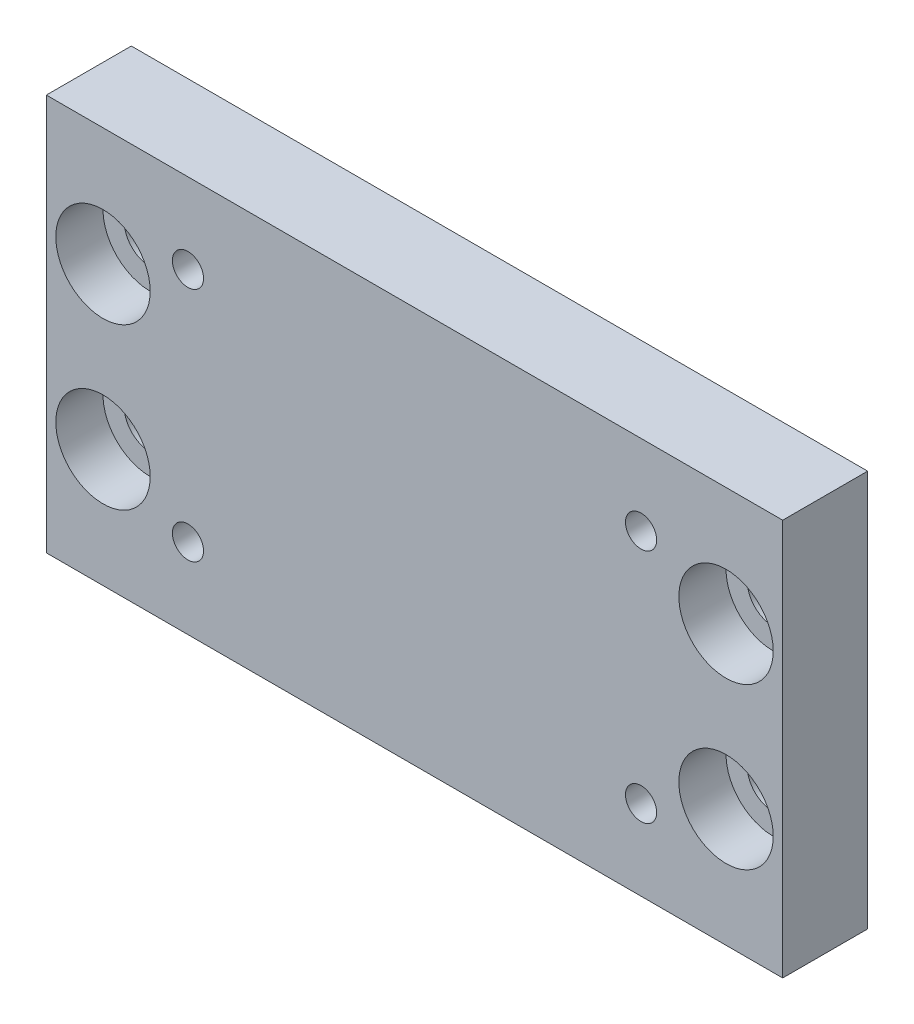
ISO-10303-21;
HEADER;
FILE_DESCRIPTION(('STEP AP214'),'2;1');
FILE_NAME('part.step','',(''),(''),'','','');
FILE_SCHEMA(('AUTOMOTIVE_DESIGN { 1 0 10303 214 1 1 1 1 }'));
ENDSEC;
DATA;
#1=APPLICATION_CONTEXT('core data for automotive mechanical design processes');
#2=APPLICATION_PROTOCOL_DEFINITION('international standard','automotive_design',2000,#1);
#3=PRODUCT_CONTEXT('',#1,'mechanical');
#4=PRODUCT('Part','Part','',(#3));
#5=PRODUCT_RELATED_PRODUCT_CATEGORY('part','',(#4));
#6=PRODUCT_DEFINITION_FORMATION('','',#4);
#7=PRODUCT_DEFINITION_CONTEXT('part definition',#1,'design');
#8=PRODUCT_DEFINITION('design','',#6,#7);
#9=PRODUCT_DEFINITION_SHAPE('','',#8);
#10=(LENGTH_UNIT() NAMED_UNIT(*) SI_UNIT(.MILLI.,.METRE.));
#11=(NAMED_UNIT(*) PLANE_ANGLE_UNIT() SI_UNIT($,.RADIAN.));
#12=(NAMED_UNIT(*) SI_UNIT($,.STERADIAN.) SOLID_ANGLE_UNIT());
#13=UNCERTAINTY_MEASURE_WITH_UNIT(LENGTH_MEASURE(1.E-05),#10,'distance_accuracy_value','');
#14=(GEOMETRIC_REPRESENTATION_CONTEXT(3) GLOBAL_UNCERTAINTY_ASSIGNED_CONTEXT((#13)) GLOBAL_UNIT_ASSIGNED_CONTEXT((#10,
#11,#12)) REPRESENTATION_CONTEXT('',''));
#15=CARTESIAN_POINT('',(0.,0.,0.));
#16=DIRECTION('',(0.,0.,1.));
#17=DIRECTION('',(1.,0.,0.));
#18=AXIS2_PLACEMENT_3D('',#15,#16,#17);
#19=CARTESIAN_POINT('',(-39.,21.,9.));
#20=DIRECTION('',(1.,0.,0.));
#21=DIRECTION('',(0.,0.,-1.));
#22=AXIS2_PLACEMENT_3D('',#19,#20,#21);
#23=PLANE('',#22);
#24=DIRECTION('',(0.,-1.,0.));
#25=VECTOR('',#24,1.);
#26=CARTESIAN_POINT('',(-39.,21.,0.));
#27=LINE('',#26,#25);
#28=CARTESIAN_POINT('',(-39.,21.,0.));
#29=VERTEX_POINT('',#28);
#30=CARTESIAN_POINT('',(-39.,-21.,0.));
#31=VERTEX_POINT('',#30);
#32=EDGE_CURVE('E82',#29,#31,#27,.T.);
#33=ORIENTED_EDGE('',*,*,#32,.T.);
#34=DIRECTION('',(0.,0.,-1.));
#35=VECTOR('',#34,1.);
#36=CARTESIAN_POINT('',(-39.,-21.,9.));
#37=LINE('',#36,#35);
#38=CARTESIAN_POINT('',(-39.,-21.,9.));
#39=VERTEX_POINT('',#38);
#40=EDGE_CURVE('E11',#39,#31,#37,.T.);
#41=ORIENTED_EDGE('',*,*,#40,.F.);
#42=DIRECTION('',(0.,-1.,0.));
#43=VECTOR('',#42,1.);
#44=CARTESIAN_POINT('',(-39.,21.,9.));
#45=LINE('',#44,#43);
#46=CARTESIAN_POINT('',(-39.,21.,9.));
#47=VERTEX_POINT('',#46);
#48=EDGE_CURVE('E105',#47,#39,#45,.T.);
#49=ORIENTED_EDGE('',*,*,#48,.F.);
#50=DIRECTION('',(0.,0.,-1.));
#51=VECTOR('',#50,1.);
#52=CARTESIAN_POINT('',(-39.,21.,9.));
#53=LINE('',#52,#51);
#54=EDGE_CURVE('E94',#47,#29,#53,.T.);
#55=ORIENTED_EDGE('',*,*,#54,.T.);
#56=EDGE_LOOP('',(#33,#41,#49,#55));
#57=FACE_BOUND('',#56,.T.);
#58=ADVANCED_FACE('F36',(#57),#23,.F.);
#59=CARTESIAN_POINT('',(-39.,-21.,9.));
#60=DIRECTION('',(0.,1.,0.));
#61=DIRECTION('',(-1.,0.,0.));
#62=AXIS2_PLACEMENT_3D('',#59,#60,#61);
#63=PLANE('',#62);
#64=DIRECTION('',(1.,0.,0.));
#65=VECTOR('',#64,1.);
#66=CARTESIAN_POINT('',(-39.,-21.,0.));
#67=LINE('',#66,#65);
#68=CARTESIAN_POINT('',(39.,-21.,0.));
#69=VERTEX_POINT('',#68);
#70=EDGE_CURVE('E78',#31,#69,#67,.T.);
#71=ORIENTED_EDGE('',*,*,#70,.T.);
#72=DIRECTION('',(0.,0.,-1.));
#73=VECTOR('',#72,1.);
#74=CARTESIAN_POINT('',(39.,-21.,9.));
#75=LINE('',#74,#73);
#76=CARTESIAN_POINT('',(39.,-21.,9.));
#77=VERTEX_POINT('',#76);
#78=EDGE_CURVE('E44',#77,#69,#75,.T.);
#79=ORIENTED_EDGE('',*,*,#78,.F.);
#80=DIRECTION('',(1.,0.,0.));
#81=VECTOR('',#80,1.);
#82=CARTESIAN_POINT('',(-39.,-21.,9.));
#83=LINE('',#82,#81);
#84=EDGE_CURVE('E90',#39,#77,#83,.T.);
#85=ORIENTED_EDGE('',*,*,#84,.F.);
#86=ORIENTED_EDGE('',*,*,#40,.T.);
#87=EDGE_LOOP('',(#71,#79,#85,#86));
#88=FACE_BOUND('',#87,.T.);
#89=ADVANCED_FACE('F89',(#88),#63,.F.);
#90=CARTESIAN_POINT('',(39.,21.,9.));
#91=DIRECTION('',(-1.,0.,0.));
#92=DIRECTION('',(0.,-1.,0.));
#93=AXIS2_PLACEMENT_3D('',#90,#91,#92);
#94=PLANE('',#93);
#95=DIRECTION('',(0.,1.,0.));
#96=VECTOR('',#95,1.);
#97=CARTESIAN_POINT('',(39.,21.,0.));
#98=LINE('',#97,#96);
#99=CARTESIAN_POINT('',(39.,21.,0.));
#100=VERTEX_POINT('',#99);
#101=EDGE_CURVE('E83',#69,#100,#98,.T.);
#102=ORIENTED_EDGE('',*,*,#101,.T.);
#103=DIRECTION('',(0.,0.,-1.));
#104=VECTOR('',#103,1.);
#105=CARTESIAN_POINT('',(39.,21.,9.));
#106=LINE('',#105,#104);
#107=CARTESIAN_POINT('',(39.,21.,9.));
#108=VERTEX_POINT('',#107);
#109=EDGE_CURVE('E111',#108,#100,#106,.T.);
#110=ORIENTED_EDGE('',*,*,#109,.F.);
#111=DIRECTION('',(0.,1.,0.));
#112=VECTOR('',#111,1.);
#113=CARTESIAN_POINT('',(39.,21.,9.));
#114=LINE('',#113,#112);
#115=EDGE_CURVE('E57',#77,#108,#114,.T.);
#116=ORIENTED_EDGE('',*,*,#115,.F.);
#117=ORIENTED_EDGE('',*,*,#78,.T.);
#118=EDGE_LOOP('',(#102,#110,#116,#117));
#119=FACE_BOUND('',#118,.T.);
#120=ADVANCED_FACE('F145',(#119),#94,.F.);
#121=CARTESIAN_POINT('',(-39.,21.,9.));
#122=DIRECTION('',(0.,-1.,0.));
#123=DIRECTION('',(1.,0.,0.));
#124=AXIS2_PLACEMENT_3D('',#121,#122,#123);
#125=PLANE('',#124);
#126=DIRECTION('',(-1.,0.,0.));
#127=VECTOR('',#126,1.);
#128=CARTESIAN_POINT('',(-39.,21.,0.));
#129=LINE('',#128,#127);
#130=EDGE_CURVE('E103',#100,#29,#129,.T.);
#131=ORIENTED_EDGE('',*,*,#130,.T.);
#132=ORIENTED_EDGE('',*,*,#54,.F.);
#133=DIRECTION('',(-1.,0.,0.));
#134=VECTOR('',#133,1.);
#135=CARTESIAN_POINT('',(-39.,21.,9.));
#136=LINE('',#135,#134);
#137=EDGE_CURVE('E52',#108,#47,#136,.T.);
#138=ORIENTED_EDGE('',*,*,#137,.F.);
#139=ORIENTED_EDGE('',*,*,#109,.T.);
#140=EDGE_LOOP('',(#131,#132,#138,#139));
#141=FACE_BOUND('',#140,.T.);
#142=ADVANCED_FACE('F141',(#141),#125,.F.);
#143=CARTESIAN_POINT('',(-39.,-21.,9.));
#144=DIRECTION('',(0.,0.,1.));
#145=DIRECTION('',(1.,0.,0.));
#146=AXIS2_PLACEMENT_3D('',#143,#144,#145);
#147=PLANE('',#146);
#148=CARTESIAN_POINT('',(-33.,8.5,9.));
#149=DIRECTION('',(0.,0.,1.));
#150=DIRECTION('',(1.,0.,0.));
#151=AXIS2_PLACEMENT_3D('',#148,#149,#150);
#152=CIRCLE('',#151,4.99999999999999);
#153=CARTESIAN_POINT('',(-28.,8.5,9.));
#154=VERTEX_POINT('',#153);
#155=EDGE_CURVE('E361',#154,#154,#152,.T.);
#156=ORIENTED_EDGE('',*,*,#155,.F.);
#157=EDGE_LOOP('',(#156));
#158=FACE_BOUND('',#157,.T.);
#159=CARTESIAN_POINT('',(-33.,-8.5,9.));
#160=DIRECTION('',(0.,0.,1.));
#161=DIRECTION('',(1.,0.,0.));
#162=AXIS2_PLACEMENT_3D('',#159,#160,#161);
#163=CIRCLE('',#162,4.99999999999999);
#164=CARTESIAN_POINT('',(-28.,-8.5,9.));
#165=VERTEX_POINT('',#164);
#166=EDGE_CURVE('E376',#165,#165,#163,.T.);
#167=ORIENTED_EDGE('',*,*,#166,.F.);
#168=EDGE_LOOP('',(#167));
#169=FACE_BOUND('',#168,.T.);
#170=CARTESIAN_POINT('',(33.,-8.5,9.));
#171=DIRECTION('',(0.,0.,1.));
#172=DIRECTION('',(1.,0.,0.));
#173=AXIS2_PLACEMENT_3D('',#170,#171,#172);
#174=CIRCLE('',#173,4.99999999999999);
#175=CARTESIAN_POINT('',(38.,-8.5,9.));
#176=VERTEX_POINT('',#175);
#177=EDGE_CURVE('E388',#176,#176,#174,.T.);
#178=ORIENTED_EDGE('',*,*,#177,.F.);
#179=EDGE_LOOP('',(#178));
#180=FACE_BOUND('',#179,.T.);
#181=CARTESIAN_POINT('',(33.,8.5,9.));
#182=DIRECTION('',(0.,0.,1.));
#183=DIRECTION('',(1.,0.,0.));
#184=AXIS2_PLACEMENT_3D('',#181,#182,#183);
#185=CIRCLE('',#184,4.99999999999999);
#186=CARTESIAN_POINT('',(38.,8.5,9.));
#187=VERTEX_POINT('',#186);
#188=EDGE_CURVE('E399',#187,#187,#185,.T.);
#189=ORIENTED_EDGE('',*,*,#188,.F.);
#190=EDGE_LOOP('',(#189));
#191=FACE_BOUND('',#190,.T.);
#192=CARTESIAN_POINT('',(-24.,12.5,9.));
#193=DIRECTION('',(0.,0.,1.));
#194=DIRECTION('',(1.,0.,0.));
#195=AXIS2_PLACEMENT_3D('',#192,#193,#194);
#196=CIRCLE('',#195,1.65);
#197=CARTESIAN_POINT('',(-22.35,12.5,9.));
#198=VERTEX_POINT('',#197);
#199=EDGE_CURVE('E130',#198,#198,#196,.T.);
#200=ORIENTED_EDGE('',*,*,#199,.F.);
#201=EDGE_LOOP('',(#200));
#202=FACE_BOUND('',#201,.T.);
#203=CARTESIAN_POINT('',(24.,12.5,9.));
#204=DIRECTION('',(0.,0.,1.));
#205=DIRECTION('',(1.,0.,0.));
#206=AXIS2_PLACEMENT_3D('',#203,#204,#205);
#207=CIRCLE('',#206,1.65);
#208=CARTESIAN_POINT('',(25.65,12.5,9.));
#209=VERTEX_POINT('',#208);
#210=EDGE_CURVE('E120',#209,#209,#207,.T.);
#211=ORIENTED_EDGE('',*,*,#210,.F.);
#212=EDGE_LOOP('',(#211));
#213=FACE_BOUND('',#212,.T.);
#214=CARTESIAN_POINT('',(24.,-12.5,9.));
#215=DIRECTION('',(0.,0.,1.));
#216=DIRECTION('',(1.,0.,0.));
#217=AXIS2_PLACEMENT_3D('',#214,#215,#216);
#218=CIRCLE('',#217,1.65);
#219=CARTESIAN_POINT('',(25.65,-12.5,9.));
#220=VERTEX_POINT('',#219);
#221=EDGE_CURVE('E117',#220,#220,#218,.T.);
#222=ORIENTED_EDGE('',*,*,#221,.F.);
#223=EDGE_LOOP('',(#222));
#224=FACE_BOUND('',#223,.T.);
#225=CARTESIAN_POINT('',(-24.,-12.5,9.));
#226=DIRECTION('',(0.,0.,1.));
#227=DIRECTION('',(1.,0.,0.));
#228=AXIS2_PLACEMENT_3D('',#225,#226,#227);
#229=CIRCLE('',#228,1.65);
#230=CARTESIAN_POINT('',(-22.35,-12.5,9.));
#231=VERTEX_POINT('',#230);
#232=EDGE_CURVE('E98',#231,#231,#229,.T.);
#233=ORIENTED_EDGE('',*,*,#232,.F.);
#234=EDGE_LOOP('',(#233));
#235=FACE_BOUND('',#234,.T.);
#236=ORIENTED_EDGE('',*,*,#48,.T.);
#237=ORIENTED_EDGE('',*,*,#84,.T.);
#238=ORIENTED_EDGE('',*,*,#115,.T.);
#239=ORIENTED_EDGE('',*,*,#137,.T.);
#240=EDGE_LOOP('',(#236,#237,#238,#239));
#241=FACE_BOUND('',#240,.T.);
#242=ADVANCED_FACE('F139',(#158,#169,#180,#191,#202,#213,#224,#235,#241),#147,.T.);
#243=CARTESIAN_POINT('',(-39.,-21.,0.));
#244=DIRECTION('',(0.,0.,1.));
#245=DIRECTION('',(1.,0.,0.));
#246=AXIS2_PLACEMENT_3D('',#243,#244,#245);
#247=PLANE('',#246);
#248=CARTESIAN_POINT('',(-33.,8.5,0.));
#249=DIRECTION('',(0.,0.,1.));
#250=DIRECTION('',(1.,0.,0.));
#251=AXIS2_PLACEMENT_3D('',#248,#249,#250);
#252=CIRCLE('',#251,2.75);
#253=CARTESIAN_POINT('',(-30.25,8.5,0.));
#254=VERTEX_POINT('',#253);
#255=EDGE_CURVE('E354',#254,#254,#252,.T.);
#256=ORIENTED_EDGE('',*,*,#255,.T.);
#257=EDGE_LOOP('',(#256));
#258=FACE_BOUND('',#257,.T.);
#259=CARTESIAN_POINT('',(-33.,-8.5,0.));
#260=DIRECTION('',(0.,0.,1.));
#261=DIRECTION('',(1.,0.,0.));
#262=AXIS2_PLACEMENT_3D('',#259,#260,#261);
#263=CIRCLE('',#262,2.75);
#264=CARTESIAN_POINT('',(-30.25,-8.5,0.));
#265=VERTEX_POINT('',#264);
#266=EDGE_CURVE('E367',#265,#265,#263,.T.);
#267=ORIENTED_EDGE('',*,*,#266,.T.);
#268=EDGE_LOOP('',(#267));
#269=FACE_BOUND('',#268,.T.);
#270=CARTESIAN_POINT('',(33.,-8.5,0.));
#271=DIRECTION('',(0.,0.,1.));
#272=DIRECTION('',(1.,0.,0.));
#273=AXIS2_PLACEMENT_3D('',#270,#271,#272);
#274=CIRCLE('',#273,2.75);
#275=CARTESIAN_POINT('',(35.75,-8.5,0.));
#276=VERTEX_POINT('',#275);
#277=EDGE_CURVE('E379',#276,#276,#274,.T.);
#278=ORIENTED_EDGE('',*,*,#277,.T.);
#279=EDGE_LOOP('',(#278));
#280=FACE_BOUND('',#279,.T.);
#281=CARTESIAN_POINT('',(33.,8.5,0.));
#282=DIRECTION('',(0.,0.,1.));
#283=DIRECTION('',(1.,0.,0.));
#284=AXIS2_PLACEMENT_3D('',#281,#282,#283);
#285=CIRCLE('',#284,2.75);
#286=CARTESIAN_POINT('',(35.75,8.5,0.));
#287=VERTEX_POINT('',#286);
#288=EDGE_CURVE('E391',#287,#287,#285,.T.);
#289=ORIENTED_EDGE('',*,*,#288,.T.);
#290=EDGE_LOOP('',(#289));
#291=FACE_BOUND('',#290,.T.);
#292=CARTESIAN_POINT('',(-24.,12.5,0.));
#293=DIRECTION('',(0.,0.,1.));
#294=DIRECTION('',(1.,0.,0.));
#295=AXIS2_PLACEMENT_3D('',#292,#293,#294);
#296=CIRCLE('',#295,1.65);
#297=CARTESIAN_POINT('',(-22.35,12.5,0.));
#298=VERTEX_POINT('',#297);
#299=EDGE_CURVE('E39',#298,#298,#296,.T.);
#300=ORIENTED_EDGE('',*,*,#299,.T.);
#301=EDGE_LOOP('',(#300));
#302=FACE_BOUND('',#301,.T.);
#303=CARTESIAN_POINT('',(24.,12.5,0.));
#304=DIRECTION('',(0.,0.,1.));
#305=DIRECTION('',(1.,0.,0.));
#306=AXIS2_PLACEMENT_3D('',#303,#304,#305);
#307=CIRCLE('',#306,1.65);
#308=CARTESIAN_POINT('',(25.65,12.5,0.));
#309=VERTEX_POINT('',#308);
#310=EDGE_CURVE('E118',#309,#309,#307,.T.);
#311=ORIENTED_EDGE('',*,*,#310,.T.);
#312=EDGE_LOOP('',(#311));
#313=FACE_BOUND('',#312,.T.);
#314=CARTESIAN_POINT('',(24.,-12.5,0.));
#315=DIRECTION('',(0.,0.,1.));
#316=DIRECTION('',(1.,0.,0.));
#317=AXIS2_PLACEMENT_3D('',#314,#315,#316);
#318=CIRCLE('',#317,1.65);
#319=CARTESIAN_POINT('',(25.65,-12.5,0.));
#320=VERTEX_POINT('',#319);
#321=EDGE_CURVE('E115',#320,#320,#318,.T.);
#322=ORIENTED_EDGE('',*,*,#321,.T.);
#323=EDGE_LOOP('',(#322));
#324=FACE_BOUND('',#323,.T.);
#325=CARTESIAN_POINT('',(-24.,-12.5,0.));
#326=DIRECTION('',(0.,0.,1.));
#327=DIRECTION('',(1.,0.,0.));
#328=AXIS2_PLACEMENT_3D('',#325,#326,#327);
#329=CIRCLE('',#328,1.65);
#330=CARTESIAN_POINT('',(-22.35,-12.5,0.));
#331=VERTEX_POINT('',#330);
#332=EDGE_CURVE('E95',#331,#331,#329,.T.);
#333=ORIENTED_EDGE('',*,*,#332,.T.);
#334=EDGE_LOOP('',(#333));
#335=FACE_BOUND('',#334,.T.);
#336=ORIENTED_EDGE('',*,*,#32,.F.);
#337=ORIENTED_EDGE('',*,*,#130,.F.);
#338=ORIENTED_EDGE('',*,*,#101,.F.);
#339=ORIENTED_EDGE('',*,*,#70,.F.);
#340=EDGE_LOOP('',(#336,#337,#338,#339));
#341=FACE_BOUND('',#340,.T.);
#342=ADVANCED_FACE('F79',(#258,#269,#280,#291,#302,#313,#324,#335,#341),#247,.F.);
#343=CARTESIAN_POINT('',(-24.,-12.5,9.));
#344=DIRECTION('',(0.,0.,1.));
#345=DIRECTION('',(1.,0.,0.));
#346=AXIS2_PLACEMENT_3D('',#343,#344,#345);
#347=CYLINDRICAL_SURFACE('',#346,1.65);
#348=ORIENTED_EDGE('',*,*,#232,.T.);
#349=EDGE_LOOP('',(#348));
#350=FACE_BOUND('',#349,.T.);
#351=ORIENTED_EDGE('',*,*,#332,.F.);
#352=EDGE_LOOP('',(#351));
#353=FACE_BOUND('',#352,.T.);
#354=ADVANCED_FACE('F136',(#350,#353),#347,.F.);
#355=CARTESIAN_POINT('',(24.,-12.5,9.));
#356=DIRECTION('',(0.,0.,1.));
#357=DIRECTION('',(1.,0.,0.));
#358=AXIS2_PLACEMENT_3D('',#355,#356,#357);
#359=CYLINDRICAL_SURFACE('',#358,1.65);
#360=ORIENTED_EDGE('',*,*,#221,.T.);
#361=EDGE_LOOP('',(#360));
#362=FACE_BOUND('',#361,.T.);
#363=ORIENTED_EDGE('',*,*,#321,.F.);
#364=EDGE_LOOP('',(#363));
#365=FACE_BOUND('',#364,.T.);
#366=ADVANCED_FACE('F178',(#362,#365),#359,.F.);
#367=CARTESIAN_POINT('',(24.,12.5,9.));
#368=DIRECTION('',(0.,0.,1.));
#369=DIRECTION('',(1.,0.,0.));
#370=AXIS2_PLACEMENT_3D('',#367,#368,#369);
#371=CYLINDRICAL_SURFACE('',#370,1.65);
#372=ORIENTED_EDGE('',*,*,#210,.T.);
#373=EDGE_LOOP('',(#372));
#374=FACE_BOUND('',#373,.T.);
#375=ORIENTED_EDGE('',*,*,#310,.F.);
#376=EDGE_LOOP('',(#375));
#377=FACE_BOUND('',#376,.T.);
#378=ADVANCED_FACE('F190',(#374,#377),#371,.F.);
#379=CARTESIAN_POINT('',(-24.,12.5,9.));
#380=DIRECTION('',(0.,0.,1.));
#381=DIRECTION('',(1.,0.,0.));
#382=AXIS2_PLACEMENT_3D('',#379,#380,#381);
#383=CYLINDRICAL_SURFACE('',#382,1.65);
#384=ORIENTED_EDGE('',*,*,#199,.T.);
#385=EDGE_LOOP('',(#384));
#386=FACE_BOUND('',#385,.T.);
#387=ORIENTED_EDGE('',*,*,#299,.F.);
#388=EDGE_LOOP('',(#387));
#389=FACE_BOUND('',#388,.T.);
#390=ADVANCED_FACE('F202',(#386,#389),#383,.F.);
#391=CARTESIAN_POINT('',(33.,8.5,9.));
#392=DIRECTION('',(0.,0.,1.));
#393=DIRECTION('',(1.,0.,0.));
#394=AXIS2_PLACEMENT_3D('',#391,#392,#393);
#395=CYLINDRICAL_SURFACE('',#394,4.99999999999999);
#396=CARTESIAN_POINT('',(33.,8.5,4.));
#397=DIRECTION('',(0.,0.,1.));
#398=DIRECTION('',(1.,0.,0.));
#399=AXIS2_PLACEMENT_3D('',#396,#397,#398);
#400=CIRCLE('',#399,5.);
#401=CARTESIAN_POINT('',(38.,8.5,4.));
#402=VERTEX_POINT('',#401);
#403=EDGE_CURVE('E397',#402,#402,#400,.T.);
#404=ORIENTED_EDGE('',*,*,#403,.F.);
#405=EDGE_LOOP('',(#404));
#406=FACE_BOUND('',#405,.T.);
#407=ORIENTED_EDGE('',*,*,#188,.T.);
#408=EDGE_LOOP('',(#407));
#409=FACE_BOUND('',#408,.T.);
#410=ADVANCED_FACE('F213',(#406,#409),#395,.F.);
#411=CARTESIAN_POINT('',(35.75,8.5,4.));
#412=DIRECTION('',(0.,0.,-1.));
#413=DIRECTION('',(-1.,0.,0.));
#414=AXIS2_PLACEMENT_3D('',#411,#412,#413);
#415=PLANE('',#414);
#416=CARTESIAN_POINT('',(33.,8.5,4.));
#417=DIRECTION('',(0.,0.,1.));
#418=DIRECTION('',(1.,0.,0.));
#419=AXIS2_PLACEMENT_3D('',#416,#417,#418);
#420=CIRCLE('',#419,2.75);
#421=CARTESIAN_POINT('',(35.75,8.5,4.));
#422=VERTEX_POINT('',#421);
#423=EDGE_CURVE('E394',#422,#422,#420,.T.);
#424=ORIENTED_EDGE('',*,*,#423,.F.);
#425=EDGE_LOOP('',(#424));
#426=FACE_BOUND('',#425,.T.);
#427=ORIENTED_EDGE('',*,*,#403,.T.);
#428=EDGE_LOOP('',(#427));
#429=FACE_BOUND('',#428,.T.);
#430=ADVANCED_FACE('F237',(#426,#429),#415,.F.);
#431=CARTESIAN_POINT('',(33.,8.5,9.));
#432=DIRECTION('',(0.,0.,1.));
#433=DIRECTION('',(1.,0.,0.));
#434=AXIS2_PLACEMENT_3D('',#431,#432,#433);
#435=CYLINDRICAL_SURFACE('',#434,2.75);
#436=ORIENTED_EDGE('',*,*,#288,.F.);
#437=EDGE_LOOP('',(#436));
#438=FACE_BOUND('',#437,.T.);
#439=ORIENTED_EDGE('',*,*,#423,.T.);
#440=EDGE_LOOP('',(#439));
#441=FACE_BOUND('',#440,.T.);
#442=ADVANCED_FACE('F247',(#438,#441),#435,.F.);
#443=CARTESIAN_POINT('',(33.,-8.5,9.));
#444=DIRECTION('',(0.,0.,1.));
#445=DIRECTION('',(1.,0.,0.));
#446=AXIS2_PLACEMENT_3D('',#443,#444,#445);
#447=CYLINDRICAL_SURFACE('',#446,4.99999999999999);
#448=CARTESIAN_POINT('',(33.,-8.5,4.));
#449=DIRECTION('',(0.,0.,1.));
#450=DIRECTION('',(1.,0.,0.));
#451=AXIS2_PLACEMENT_3D('',#448,#449,#450);
#452=CIRCLE('',#451,5.);
#453=CARTESIAN_POINT('',(38.,-8.5,4.));
#454=VERTEX_POINT('',#453);
#455=EDGE_CURVE('E385',#454,#454,#452,.T.);
#456=ORIENTED_EDGE('',*,*,#455,.F.);
#457=EDGE_LOOP('',(#456));
#458=FACE_BOUND('',#457,.T.);
#459=ORIENTED_EDGE('',*,*,#177,.T.);
#460=EDGE_LOOP('',(#459));
#461=FACE_BOUND('',#460,.T.);
#462=ADVANCED_FACE('F257',(#458,#461),#447,.F.);
#463=CARTESIAN_POINT('',(35.75,-8.5,4.));
#464=DIRECTION('',(0.,0.,-1.));
#465=DIRECTION('',(-1.,0.,0.));
#466=AXIS2_PLACEMENT_3D('',#463,#464,#465);
#467=PLANE('',#466);
#468=CARTESIAN_POINT('',(33.,-8.5,4.));
#469=DIRECTION('',(0.,0.,1.));
#470=DIRECTION('',(1.,0.,0.));
#471=AXIS2_PLACEMENT_3D('',#468,#469,#470);
#472=CIRCLE('',#471,2.75);
#473=CARTESIAN_POINT('',(35.75,-8.5,4.));
#474=VERTEX_POINT('',#473);
#475=EDGE_CURVE('E382',#474,#474,#472,.T.);
#476=ORIENTED_EDGE('',*,*,#475,.F.);
#477=EDGE_LOOP('',(#476));
#478=FACE_BOUND('',#477,.T.);
#479=ORIENTED_EDGE('',*,*,#455,.T.);
#480=EDGE_LOOP('',(#479));
#481=FACE_BOUND('',#480,.T.);
#482=ADVANCED_FACE('F267',(#478,#481),#467,.F.);
#483=CARTESIAN_POINT('',(33.,-8.5,9.));
#484=DIRECTION('',(0.,0.,1.));
#485=DIRECTION('',(1.,0.,0.));
#486=AXIS2_PLACEMENT_3D('',#483,#484,#485);
#487=CYLINDRICAL_SURFACE('',#486,2.75);
#488=ORIENTED_EDGE('',*,*,#277,.F.);
#489=EDGE_LOOP('',(#488));
#490=FACE_BOUND('',#489,.T.);
#491=ORIENTED_EDGE('',*,*,#475,.T.);
#492=EDGE_LOOP('',(#491));
#493=FACE_BOUND('',#492,.T.);
#494=ADVANCED_FACE('F277',(#490,#493),#487,.F.);
#495=CARTESIAN_POINT('',(-33.,-8.5,9.));
#496=DIRECTION('',(0.,0.,1.));
#497=DIRECTION('',(1.,0.,0.));
#498=AXIS2_PLACEMENT_3D('',#495,#496,#497);
#499=CYLINDRICAL_SURFACE('',#498,5.);
#500=CARTESIAN_POINT('',(-33.,-8.5,4.));
#501=DIRECTION('',(0.,0.,1.));
#502=DIRECTION('',(1.,0.,0.));
#503=AXIS2_PLACEMENT_3D('',#500,#501,#502);
#504=CIRCLE('',#503,5.);
#505=CARTESIAN_POINT('',(-28.,-8.5,4.));
#506=VERTEX_POINT('',#505);
#507=EDGE_CURVE('E373',#506,#506,#504,.T.);
#508=ORIENTED_EDGE('',*,*,#507,.F.);
#509=EDGE_LOOP('',(#508));
#510=FACE_BOUND('',#509,.T.);
#511=ORIENTED_EDGE('',*,*,#166,.T.);
#512=EDGE_LOOP('',(#511));
#513=FACE_BOUND('',#512,.T.);
#514=ADVANCED_FACE('F287',(#510,#513),#499,.F.);
#515=CARTESIAN_POINT('',(-30.25,-8.5,4.));
#516=DIRECTION('',(0.,0.,-1.));
#517=DIRECTION('',(-1.,0.,0.));
#518=AXIS2_PLACEMENT_3D('',#515,#516,#517);
#519=PLANE('',#518);
#520=CARTESIAN_POINT('',(-33.,-8.5,4.));
#521=DIRECTION('',(0.,0.,1.));
#522=DIRECTION('',(1.,0.,0.));
#523=AXIS2_PLACEMENT_3D('',#520,#521,#522);
#524=CIRCLE('',#523,2.75);
#525=CARTESIAN_POINT('',(-30.25,-8.5,4.));
#526=VERTEX_POINT('',#525);
#527=EDGE_CURVE('E370',#526,#526,#524,.T.);
#528=ORIENTED_EDGE('',*,*,#527,.F.);
#529=EDGE_LOOP('',(#528));
#530=FACE_BOUND('',#529,.T.);
#531=ORIENTED_EDGE('',*,*,#507,.T.);
#532=EDGE_LOOP('',(#531));
#533=FACE_BOUND('',#532,.T.);
#534=ADVANCED_FACE('F297',(#530,#533),#519,.F.);
#535=CARTESIAN_POINT('',(-33.,-8.5,9.));
#536=DIRECTION('',(0.,0.,1.));
#537=DIRECTION('',(1.,0.,0.));
#538=AXIS2_PLACEMENT_3D('',#535,#536,#537);
#539=CYLINDRICAL_SURFACE('',#538,2.75);
#540=ORIENTED_EDGE('',*,*,#266,.F.);
#541=EDGE_LOOP('',(#540));
#542=FACE_BOUND('',#541,.T.);
#543=ORIENTED_EDGE('',*,*,#527,.T.);
#544=EDGE_LOOP('',(#543));
#545=FACE_BOUND('',#544,.T.);
#546=ADVANCED_FACE('F307',(#542,#545),#539,.F.);
#547=CARTESIAN_POINT('',(-33.,8.5,9.));
#548=DIRECTION('',(0.,0.,1.));
#549=DIRECTION('',(1.,0.,0.));
#550=AXIS2_PLACEMENT_3D('',#547,#548,#549);
#551=CYLINDRICAL_SURFACE('',#550,5.);
#552=CARTESIAN_POINT('',(-33.,8.5,4.));
#553=DIRECTION('',(0.,0.,1.));
#554=DIRECTION('',(1.,0.,0.));
#555=AXIS2_PLACEMENT_3D('',#552,#553,#554);
#556=CIRCLE('',#555,5.);
#557=CARTESIAN_POINT('',(-28.,8.5,4.));
#558=VERTEX_POINT('',#557);
#559=EDGE_CURVE('E358',#558,#558,#556,.T.);
#560=ORIENTED_EDGE('',*,*,#559,.F.);
#561=EDGE_LOOP('',(#560));
#562=FACE_BOUND('',#561,.T.);
#563=ORIENTED_EDGE('',*,*,#155,.T.);
#564=EDGE_LOOP('',(#563));
#565=FACE_BOUND('',#564,.T.);
#566=ADVANCED_FACE('F317',(#562,#565),#551,.F.);
#567=CARTESIAN_POINT('',(-30.25,8.5,4.));
#568=DIRECTION('',(0.,0.,-1.));
#569=DIRECTION('',(-1.,0.,0.));
#570=AXIS2_PLACEMENT_3D('',#567,#568,#569);
#571=PLANE('',#570);
#572=CARTESIAN_POINT('',(-33.,8.5,4.));
#573=DIRECTION('',(0.,0.,1.));
#574=DIRECTION('',(1.,0.,0.));
#575=AXIS2_PLACEMENT_3D('',#572,#573,#574);
#576=CIRCLE('',#575,2.75);
#577=CARTESIAN_POINT('',(-30.25,8.5,4.));
#578=VERTEX_POINT('',#577);
#579=EDGE_CURVE('E357',#578,#578,#576,.T.);
#580=ORIENTED_EDGE('',*,*,#579,.F.);
#581=EDGE_LOOP('',(#580));
#582=FACE_BOUND('',#581,.T.);
#583=ORIENTED_EDGE('',*,*,#559,.T.);
#584=EDGE_LOOP('',(#583));
#585=FACE_BOUND('',#584,.T.);
#586=ADVANCED_FACE('F327',(#582,#585),#571,.F.);
#587=CARTESIAN_POINT('',(-33.,8.5,9.));
#588=DIRECTION('',(0.,0.,1.));
#589=DIRECTION('',(1.,0.,0.));
#590=AXIS2_PLACEMENT_3D('',#587,#588,#589);
#591=CYLINDRICAL_SURFACE('',#590,2.75);
#592=ORIENTED_EDGE('',*,*,#255,.F.);
#593=EDGE_LOOP('',(#592));
#594=FACE_BOUND('',#593,.T.);
#595=ORIENTED_EDGE('',*,*,#579,.T.);
#596=EDGE_LOOP('',(#595));
#597=FACE_BOUND('',#596,.T.);
#598=ADVANCED_FACE('F337',(#594,#597),#591,.F.);
#599=CLOSED_SHELL('',(#58,#89,#120,#142,#242,#342,#354,#366,#378,#390,#410,#430,#442,#462,#482,
#494,#514,#534,#546,#566,#586,#598));
#600=MANIFOLD_SOLID_BREP('B2',#599);
#601=ADVANCED_BREP_SHAPE_REPRESENTATION('',(#18,#600),#14);
#602=SHAPE_DEFINITION_REPRESENTATION(#9,#601);
ENDSEC;
END-ISO-10303-21;
